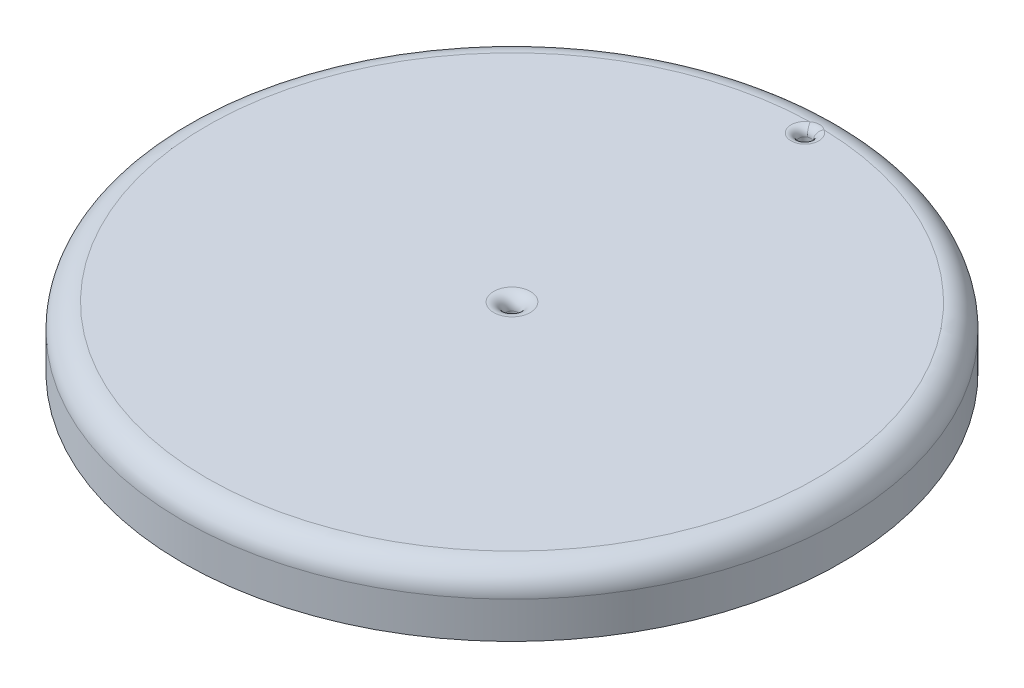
ISO-10303-21;
HEADER;
FILE_DESCRIPTION(('STEP AP214'),'2;1');
FILE_NAME('part.step','',(''),(''),'','','');
FILE_SCHEMA(('AUTOMOTIVE_DESIGN { 1 0 10303 214 1 1 1 1 }'));
ENDSEC;
DATA;
#1=APPLICATION_CONTEXT('core data for automotive mechanical design processes');
#2=APPLICATION_PROTOCOL_DEFINITION('international standard','automotive_design',2000,#1);
#3=PRODUCT_CONTEXT('',#1,'mechanical');
#4=PRODUCT('Part','Part','',(#3));
#5=PRODUCT_RELATED_PRODUCT_CATEGORY('part','',(#4));
#6=PRODUCT_DEFINITION_FORMATION('','',#4);
#7=PRODUCT_DEFINITION_CONTEXT('part definition',#1,'design');
#8=PRODUCT_DEFINITION('design','',#6,#7);
#9=PRODUCT_DEFINITION_SHAPE('','',#8);
#10=(LENGTH_UNIT() NAMED_UNIT(*) SI_UNIT(.MILLI.,.METRE.));
#11=(NAMED_UNIT(*) PLANE_ANGLE_UNIT() SI_UNIT($,.RADIAN.));
#12=(NAMED_UNIT(*) SI_UNIT($,.STERADIAN.) SOLID_ANGLE_UNIT());
#13=UNCERTAINTY_MEASURE_WITH_UNIT(LENGTH_MEASURE(1.E-05),#10,'distance_accuracy_value','');
#14=(GEOMETRIC_REPRESENTATION_CONTEXT(3) GLOBAL_UNCERTAINTY_ASSIGNED_CONTEXT((#13)) GLOBAL_UNIT_ASSIGNED_CONTEXT((#10,
#11,#12)) REPRESENTATION_CONTEXT('',''));
#15=CARTESIAN_POINT('',(0.,0.,0.));
#16=DIRECTION('',(0.,0.,1.));
#17=DIRECTION('',(1.,0.,0.));
#18=AXIS2_PLACEMENT_3D('',#15,#16,#17);
#19=CARTESIAN_POINT('',(0.,15.875,0.));
#20=DIRECTION('',(0.,1.,0.));
#21=DIRECTION('',(0.,0.,1.));
#22=AXIS2_PLACEMENT_3D('',#19,#20,#21);
#23=PLANE('',#22);
#24=CARTESIAN_POINT('',(0.,15.875,0.));
#25=DIRECTION('',(0.,1.,0.));
#26=DIRECTION('',(0.,0.,1.));
#27=AXIS2_PLACEMENT_3D('',#24,#25,#26);
#28=CIRCLE('',#27,4.7625);
#29=CARTESIAN_POINT('',(0.,15.875,4.7625));
#30=VERTEX_POINT('',#29);
#31=EDGE_CURVE('E79',#30,#30,#28,.F.);
#32=ORIENTED_EDGE('',*,*,#31,.T.);
#33=EDGE_LOOP('',(#32));
#34=FACE_BOUND('',#33,.T.);
#35=CARTESIAN_POINT('',(0.,15.875,0.));
#36=DIRECTION('',(0.,1.,0.));
#37=DIRECTION('',(0.,0.,1.));
#38=AXIS2_PLACEMENT_3D('',#35,#36,#37);
#39=CIRCLE('',#38,79.375);
#40=CARTESIAN_POINT('',(-1.77358459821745,15.875,-79.3551827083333));
#41=VERTEX_POINT('',#40);
#42=CARTESIAN_POINT('',(1.77358459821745,15.875,-79.3551827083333));
#43=VERTEX_POINT('',#42);
#44=EDGE_CURVE('E127',#41,#43,#39,.T.);
#45=ORIENTED_EDGE('',*,*,#44,.T.);
#46=CARTESIAN_POINT('',(0.,15.875,-76.2));
#47=DIRECTION('',(0.,1.,0.));
#48=DIRECTION('',(0.,0.,1.));
#49=AXIS2_PLACEMENT_3D('',#46,#47,#48);
#50=CIRCLE('',#49,3.6195);
#51=EDGE_CURVE('E49',#43,#41,#50,.F.);
#52=ORIENTED_EDGE('',*,*,#51,.T.);
#53=EDGE_LOOP('',(#45,#52));
#54=FACE_BOUND('',#53,.T.);
#55=ADVANCED_FACE('F36',(#34,#54),#23,.T.);
#56=CARTESIAN_POINT('',(0.,0.,0.));
#57=DIRECTION('',(0.,1.,0.));
#58=DIRECTION('',(0.,0.,1.));
#59=AXIS2_PLACEMENT_3D('',#56,#57,#58);
#60=PLANE('',#59);
#61=CARTESIAN_POINT('',(0.,0.,0.));
#62=DIRECTION('',(0.,1.,0.));
#63=DIRECTION('',(0.,0.,1.));
#64=AXIS2_PLACEMENT_3D('',#61,#62,#63);
#65=CIRCLE('',#64,1.5875);
#66=CARTESIAN_POINT('',(0.,0.,1.5875));
#67=VERTEX_POINT('',#66);
#68=EDGE_CURVE('E117',#67,#67,#65,.T.);
#69=ORIENTED_EDGE('',*,*,#68,.T.);
#70=EDGE_LOOP('',(#69));
#71=FACE_BOUND('',#70,.T.);
#72=CARTESIAN_POINT('',(0.,0.,0.));
#73=DIRECTION('',(0.,1.,0.));
#74=DIRECTION('',(0.,0.,1.));
#75=AXIS2_PLACEMENT_3D('',#72,#73,#74);
#76=CIRCLE('',#75,85.725);
#77=CARTESIAN_POINT('',(0.,0.,85.725));
#78=VERTEX_POINT('',#77);
#79=EDGE_CURVE('E122',#78,#78,#76,.T.);
#80=ORIENTED_EDGE('',*,*,#79,.F.);
#81=EDGE_LOOP('',(#80));
#82=FACE_BOUND('',#81,.T.);
#83=CARTESIAN_POINT('',(0.,0.,-76.2));
#84=DIRECTION('',(0.,1.,0.));
#85=DIRECTION('',(0.,0.,1.));
#86=AXIS2_PLACEMENT_3D('',#83,#84,#85);
#87=CIRCLE('',#86,1.5875);
#88=CARTESIAN_POINT('',(0.,0.,-74.6125));
#89=VERTEX_POINT('',#88);
#90=EDGE_CURVE('E115',#89,#89,#87,.T.);
#91=ORIENTED_EDGE('',*,*,#90,.T.);
#92=EDGE_LOOP('',(#91));
#93=FACE_BOUND('',#92,.T.);
#94=ADVANCED_FACE('F147',(#71,#82,#93),#60,.F.);
#95=CARTESIAN_POINT('',(0.,15.875,0.));
#96=DIRECTION('',(0.,-1.,0.));
#97=DIRECTION('',(0.,0.,-1.));
#98=AXIS2_PLACEMENT_3D('',#95,#96,#97);
#99=CYLINDRICAL_SURFACE('',#98,85.725);
#100=CARTESIAN_POINT('',(0.,9.525,0.));
#101=DIRECTION('',(0.,1.,0.));
#102=DIRECTION('',(0.,0.,1.));
#103=AXIS2_PLACEMENT_3D('',#100,#101,#102);
#104=CIRCLE('',#103,85.725);
#105=CARTESIAN_POINT('',(0.,9.525,85.725));
#106=VERTEX_POINT('',#105);
#107=EDGE_CURVE('E129',#106,#106,#104,.F.);
#108=ORIENTED_EDGE('',*,*,#107,.T.);
#109=EDGE_LOOP('',(#108));
#110=FACE_BOUND('',#109,.T.);
#111=ORIENTED_EDGE('',*,*,#79,.T.);
#112=EDGE_LOOP('',(#111));
#113=FACE_BOUND('',#112,.T.);
#114=ADVANCED_FACE('F109',(#110,#113),#99,.T.);
#115=CARTESIAN_POINT('',(0.,15.875,0.));
#116=DIRECTION('',(0.,-1.,0.));
#117=DIRECTION('',(0.,0.,-1.));
#118=AXIS2_PLACEMENT_3D('',#115,#116,#117);
#119=CYLINDRICAL_SURFACE('',#118,1.5875);
#120=CARTESIAN_POINT('',(0.,12.7,0.));
#121=DIRECTION('',(0.,1.,0.));
#122=DIRECTION('',(0.,0.,1.));
#123=AXIS2_PLACEMENT_3D('',#120,#121,#122);
#124=CIRCLE('',#123,1.5875);
#125=CARTESIAN_POINT('',(0.,12.7,1.5875));
#126=VERTEX_POINT('',#125);
#127=EDGE_CURVE('E132',#126,#126,#124,.T.);
#128=ORIENTED_EDGE('',*,*,#127,.T.);
#129=EDGE_LOOP('',(#128));
#130=FACE_BOUND('',#129,.T.);
#131=ORIENTED_EDGE('',*,*,#68,.F.);
#132=EDGE_LOOP('',(#131));
#133=FACE_BOUND('',#132,.T.);
#134=ADVANCED_FACE('F142',(#130,#133),#119,.F.);
#135=CARTESIAN_POINT('',(0.,15.875,-76.2));
#136=DIRECTION('',(0.,-1.,0.));
#137=DIRECTION('',(0.,0.,-1.));
#138=AXIS2_PLACEMENT_3D('',#135,#136,#137);
#139=CYLINDRICAL_SURFACE('',#138,1.5875);
#140=CARTESIAN_POINT('',(0.,13.843,-76.2));
#141=DIRECTION('',(0.,1.,0.));
#142=DIRECTION('',(0.,0.,1.));
#143=AXIS2_PLACEMENT_3D('',#140,#141,#142);
#144=CIRCLE('',#143,1.5875);
#145=CARTESIAN_POINT('',(-0.777887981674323,13.843,-77.5838520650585));
#146=VERTEX_POINT('',#145);
#147=CARTESIAN_POINT('',(0.777887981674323,13.843,-77.5838520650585));
#148=VERTEX_POINT('',#147);
#149=EDGE_CURVE('E77',#146,#148,#144,.T.);
#150=ORIENTED_EDGE('',*,*,#149,.T.);
#151=CARTESIAN_POINT('',(2.63476197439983,15.8003909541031,-78.360166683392));
#152=CARTESIAN_POINT('',(1.29553027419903,15.6046192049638,-77.1386593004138));
#153=CARTESIAN_POINT('',(1.16017491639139,13.7922658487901,-77.2835822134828));
#154=CARTESIAN_POINT('',(2.57294908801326,15.8152666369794,-78.4585026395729));
#155=CARTESIAN_POINT('',(1.25561948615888,15.6322657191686,-77.1888661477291));
#156=CARTESIAN_POINT('',(1.13249688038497,13.8023813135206,-77.3132212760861));
#157=CARTESIAN_POINT('',(2.50832767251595,15.8273547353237,-78.553426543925));
#158=CARTESIAN_POINT('',(1.21430838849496,15.6583466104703,-77.2355977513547));
#159=CARTESIAN_POINT('',(1.10363331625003,13.8106012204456,-77.3418428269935));
#160=CARTESIAN_POINT('',(2.37392623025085,15.8468919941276,-78.7357579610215));
#161=CARTESIAN_POINT('',(1.1296876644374,15.7079386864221,-77.3225792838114));
#162=CARTESIAN_POINT('',(1.0437372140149,13.823886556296,-77.3968373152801));
#163=CARTESIAN_POINT('',(2.30414921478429,15.8543438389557,-78.823169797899));
#164=CARTESIAN_POINT('',(1.08633357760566,15.731447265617,-77.3628095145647));
#165=CARTESIAN_POINT('',(1.01270594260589,13.8289538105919,-77.4232115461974));
#166=CARTESIAN_POINT('',(2.08797842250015,15.8711430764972,-79.0728964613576));
#167=CARTESIAN_POINT('',(0.954443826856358,15.7988444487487,-77.4741569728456));
#168=CARTESIAN_POINT('',(0.916754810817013,13.8403772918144,-77.4985817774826));
#169=CARTESIAN_POINT('',(1.93446767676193,15.874991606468,-79.2231430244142));
#170=CARTESIAN_POINT('',(0.864910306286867,15.839058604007,-77.5349037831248));
#171=CARTESIAN_POINT('',(0.848853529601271,13.8429942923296,-77.5439581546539));
#172=CARTESIAN_POINT('',(1.59737548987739,15.8750091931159,-79.4998007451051));
#173=CARTESIAN_POINT('',(0.680776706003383,15.9151082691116,-77.6384751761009));
#174=CARTESIAN_POINT('',(0.700162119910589,13.843006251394,-77.6275463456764));
#175=CARTESIAN_POINT('',(1.41232254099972,15.870411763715,-79.6225778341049));
#176=CARTESIAN_POINT('',(0.58694637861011,15.9498324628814,-77.6783200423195));
#177=CARTESIAN_POINT('',(0.618760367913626,13.8398799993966,-77.6646638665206));
#178=CARTESIAN_POINT('',(1.02991920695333,15.8595849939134,-79.8212372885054));
#179=CARTESIAN_POINT('',(0.408131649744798,16.0082118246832,-77.7377187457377));
#180=CARTESIAN_POINT('',(0.450866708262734,13.8325177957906,-77.7247378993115));
#181=CARTESIAN_POINT('',(0.832564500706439,15.8533550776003,-79.8971030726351));
#182=CARTESIAN_POINT('',(0.323813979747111,16.0315118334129,-77.7567594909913));
#183=CARTESIAN_POINT('',(0.364373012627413,13.8282814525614,-77.7476894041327));
#184=CARTESIAN_POINT('',(0.431488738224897,15.8442989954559,-79.9997887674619));
#185=CARTESIAN_POINT('',(0.162220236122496,16.0638111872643,-77.7815404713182));
#186=CARTESIAN_POINT('',(0.188758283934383,13.8221233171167,-77.7787575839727));
#187=CARTESIAN_POINT('',(0.227768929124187,15.8414721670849,-80.0266182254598));
#188=CARTESIAN_POINT('',(0.0856994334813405,16.0725404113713,-77.78705194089));
#189=CARTESIAN_POINT('',(0.0996377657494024,13.8202010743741,-77.7868771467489));
#190=CARTESIAN_POINT('',(-0.179926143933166,15.8410812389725,-80.0305067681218));
#191=CARTESIAN_POINT('',(-0.0677330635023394,16.0737995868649,-77.7878985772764));
#192=CARTESIAN_POINT('',(-0.0787089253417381,13.8199352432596,-77.7880538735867));
#193=CARTESIAN_POINT('',(-0.383901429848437,15.8435176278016,-80.0075612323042));
#194=CARTESIAN_POINT('',(-0.143910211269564,16.0663160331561,-77.7832249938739));
#195=CARTESIAN_POINT('',(-0.167935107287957,13.8215919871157,-77.7811096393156));
#196=CARTESIAN_POINT('',(-0.793802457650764,15.8522364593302,-79.9106665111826));
#197=CARTESIAN_POINT('',(-0.307524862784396,16.035720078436,-77.7601685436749));
#198=CARTESIAN_POINT('',(-0.347389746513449,13.8275207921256,-77.7517927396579));
#199=CARTESIAN_POINT('',(-0.999493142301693,15.8586654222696,-79.8347599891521));
#200=CARTESIAN_POINT('',(-0.394481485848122,16.0122886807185,-77.7414868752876));
#201=CARTESIAN_POINT('',(-0.437521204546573,13.8318924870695,-77.7288279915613));
#202=CARTESIAN_POINT('',(-1.39783616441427,15.8700525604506,-79.6321430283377));
#203=CARTESIAN_POINT('',(-0.579575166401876,15.9525759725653,-77.6814351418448));
#204=CARTESIAN_POINT('',(-0.612388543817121,13.8396357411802,-77.6675555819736));
#205=CARTESIAN_POINT('',(-1.59049234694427,15.8750111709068,-79.5054476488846));
#206=CARTESIAN_POINT('',(-0.676953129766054,15.9166930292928,-77.6406278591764));
#207=CARTESIAN_POINT('',(-0.697126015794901,13.843007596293,-77.6292524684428));
#208=CARTESIAN_POINT('',(-1.93450101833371,15.874990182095,-79.2231176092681));
#209=CARTESIAN_POINT('',(-0.864920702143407,15.8390495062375,-77.5348962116));
#210=CARTESIAN_POINT('',(-0.848868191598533,13.8429933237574,-77.5439504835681));
#211=CARTESIAN_POINT('',(-2.0880299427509,15.8711415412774,-79.0728466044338));
#212=CARTESIAN_POINT('',(-0.954472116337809,15.7988308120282,-77.4741373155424));
#213=CARTESIAN_POINT('',(-0.916777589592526,13.8403762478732,-77.498566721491));
#214=CARTESIAN_POINT('',(-2.30420464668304,15.8543382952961,-78.8231009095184));
#215=CARTESIAN_POINT('',(-1.08636872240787,15.7314289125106,-77.3627777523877));
#216=CARTESIAN_POINT('',(-1.01273059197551,13.8289500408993,-77.4231907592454));
#217=CARTESIAN_POINT('',(-2.37396843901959,15.8468866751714,-78.7357025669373));
#218=CARTESIAN_POINT('',(-1.12971452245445,15.7079237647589,-77.3225531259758));
#219=CARTESIAN_POINT('',(-1.04375600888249,13.8238829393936,-77.3968206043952));
#220=CARTESIAN_POINT('',(-2.50834716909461,15.8273510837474,-78.5533982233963));
#221=CARTESIAN_POINT('',(-1.21432050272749,15.6583387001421,-77.2355838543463));
#222=CARTESIAN_POINT('',(-1.10364202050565,13.8105987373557,-77.34183428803));
#223=CARTESIAN_POINT('',(-2.57295894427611,15.8152642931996,-78.4584876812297));
#224=CARTESIAN_POINT('',(-1.25562507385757,15.6322613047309,-77.1888586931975));
#225=CARTESIAN_POINT('',(-1.13250128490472,13.8023797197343,-77.3132167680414));
#226=CARTESIAN_POINT('',(-2.63476197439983,15.8003909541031,-78.360166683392));
#227=CARTESIAN_POINT('',(-1.29553027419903,15.6046192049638,-77.1386593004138));
#228=CARTESIAN_POINT('',(-1.16017491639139,13.7922658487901,-77.2835822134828));
#229=(BOUNDED_SURFACE() B_SPLINE_SURFACE(3,2,((#151,#152,#153),(#154,#155,#156),(#157,#158,
#159),(#160,#161,#162),(#163,#164,#165),(#166,#167,#168),(#169,#170,#171),(#172,#173,#174),
(#175,#176,#177),(#178,#179,#180),(#181,#182,#183),(#184,#185,#186),(#187,#188,#189),(#190,#191,
#192),(#193,#194,#195),(#196,#197,#198),(#199,#200,#201),(#202,#203,#204),(#205,#206,#207),
(#208,#209,#210),(#211,#212,#213),(#214,#215,#216),(#217,#218,#219),(#220,#221,#222),(#223,#224,
#225),(#226,#227,#228)),.UNSPECIFIED.,.F.,.F.,.F.) B_SPLINE_SURFACE_WITH_KNOTS((4,2,2,2,2,2,2,2,
2,2,2,2,4),(3,3),(0.,0.278848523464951,0.557535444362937,1.11367568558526,1.72279490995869,
2.33212931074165,2.94134506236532,3.55061736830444,4.18368960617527,4.81657427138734,
5.37280499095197,5.6514424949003,5.93024974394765),(0.,1.),
.UNSPECIFIED.) GEOMETRIC_REPRESENTATION_ITEM() RATIONAL_B_SPLINE_SURFACE(((1.,0.744318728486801,
1.),(1.,0.741621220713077,1.),(1.,0.738734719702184,1.),(1.,0.732715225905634,1.),(1.,
0.72958237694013,1.),(1.,0.720020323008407,1.),(1.,0.713414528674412,1.),(1.,0.700198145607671,
1.),(1.,0.693647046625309,1.),(1.,0.682501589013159,1.),(1.,0.677907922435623,1.),(1.,
0.671584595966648,1.),(1.,0.669854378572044,1.),(1.,0.669606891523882,1.),(1.,0.671089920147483,
1.),(1.,0.677085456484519,1.),(1.,0.681714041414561,1.),(1.,0.693135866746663,1.),(1.,
0.699928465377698,1.),(1.,0.713415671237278,1.),(1.,0.720022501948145,1.),(1.,0.729584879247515,
1.),(1.,0.73271712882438,1.),(1.,0.738735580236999,1.),(1.,0.741621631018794,1.),(1.,
0.744318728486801,1.))) REPRESENTATION_ITEM('') SURFACE());
#230=CARTESIAN_POINT('',(1.16017491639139,13.7922658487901,-77.2835822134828));
#231=CARTESIAN_POINT('',(1.13249688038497,13.8023813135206,-77.3132212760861));
#232=CARTESIAN_POINT('',(1.10363331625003,13.8106012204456,-77.3418428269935));
#233=CARTESIAN_POINT('',(1.0437372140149,13.823886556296,-77.3968373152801));
#234=CARTESIAN_POINT('',(1.01270594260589,13.8289538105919,-77.4232115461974));
#235=CARTESIAN_POINT('',(0.916754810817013,13.8403772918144,-77.4985817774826));
#236=CARTESIAN_POINT('',(0.848853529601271,13.8429942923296,-77.5439581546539));
#237=CARTESIAN_POINT('',(0.700162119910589,13.843006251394,-77.6275463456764));
#238=CARTESIAN_POINT('',(0.618760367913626,13.8398799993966,-77.6646638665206));
#239=CARTESIAN_POINT('',(0.450866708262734,13.8325177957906,-77.7247378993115));
#240=CARTESIAN_POINT('',(0.364373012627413,13.8282814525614,-77.7476894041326));
#241=CARTESIAN_POINT('',(0.188758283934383,13.8221233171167,-77.7787575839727));
#242=CARTESIAN_POINT('',(0.0996377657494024,13.8202010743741,-77.7868771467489));
#243=CARTESIAN_POINT('',(-0.0787089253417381,13.8199352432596,-77.7880538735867));
#244=CARTESIAN_POINT('',(-0.167935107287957,13.8215919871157,-77.7811096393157));
#245=CARTESIAN_POINT('',(-0.347389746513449,13.8275207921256,-77.7517927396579));
#246=CARTESIAN_POINT('',(-0.437521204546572,13.8318924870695,-77.7288279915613));
#247=CARTESIAN_POINT('',(-0.612388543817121,13.8396357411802,-77.6675555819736));
#248=CARTESIAN_POINT('',(-0.697126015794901,13.843007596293,-77.6292524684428));
#249=CARTESIAN_POINT('',(-0.848868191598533,13.8429933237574,-77.5439504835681));
#250=CARTESIAN_POINT('',(-0.916777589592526,13.8403762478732,-77.498566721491));
#251=CARTESIAN_POINT('',(-1.01273059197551,13.8289500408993,-77.4231907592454));
#252=CARTESIAN_POINT('',(-1.04375600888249,13.8238829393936,-77.3968206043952));
#253=CARTESIAN_POINT('',(-1.10364202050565,13.8105987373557,-77.34183428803));
#254=CARTESIAN_POINT('',(-1.13250128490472,13.8023797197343,-77.3132167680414));
#255=CARTESIAN_POINT('',(-1.16017491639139,13.7922658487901,-77.2835822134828));
#256=B_SPLINE_CURVE_WITH_KNOTS('',3,(#230,#231,#232,#233,#234,#235,#236,#237,#238,#239,#240,
#241,#242,#243,#244,#245,#246,#247,#248,#249,#250,#251,#252,#253,#254,#255),.UNSPECIFIED.,.F.,
.F.,(4,2,2,2,2,2,2,2,2,2,2,2,4),(0.,0.278848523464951,0.557535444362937,1.11367568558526,
1.72279490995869,2.33212931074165,2.94134506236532,3.55061736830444,4.18368960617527,
4.81657427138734,5.37280499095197,5.6514424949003,5.93024974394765),.UNSPECIFIED.);
#257=EDGE_CURVE('E74',#148,#146,#256,.T.);
#258=ORIENTED_EDGE('',*,*,#257,.T.);
#259=EDGE_LOOP('',(#150,#258));
#260=FACE_BOUND('',#259,.T.);
#261=ORIENTED_EDGE('',*,*,#90,.F.);
#262=EDGE_LOOP('',(#261));
#263=FACE_BOUND('',#262,.T.);
#264=ADVANCED_FACE('F81',(#260,#263),#139,.F.);
#265=CARTESIAN_POINT('',(0.,9.525,0.));
#266=DIRECTION('',(0.,1.,0.));
#267=DIRECTION('',(0.,0.,1.));
#268=AXIS2_PLACEMENT_3D('',#265,#266,#267);
#269=TOROIDAL_SURFACE('',#268,79.375,6.35);
#270=ORIENTED_EDGE('',*,*,#107,.F.);
#271=EDGE_LOOP('',(#270));
#272=FACE_BOUND('',#271,.T.);
#273=ORIENTED_EDGE('',*,*,#44,.F.);
#274=CARTESIAN_POINT('',(-2.63476197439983,15.8003909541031,-78.360166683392));
#275=CARTESIAN_POINT('',(-2.57295894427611,15.8152642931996,-78.4584876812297));
#276=CARTESIAN_POINT('',(-2.50834716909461,15.8273510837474,-78.5533982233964));
#277=CARTESIAN_POINT('',(-2.37396843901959,15.8468866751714,-78.7357025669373));
#278=CARTESIAN_POINT('',(-2.30420464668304,15.8543382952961,-78.8231009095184));
#279=CARTESIAN_POINT('',(-2.0880299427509,15.8711415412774,-79.0728466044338));
#280=CARTESIAN_POINT('',(-1.93450101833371,15.874990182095,-79.223117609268));
#281=CARTESIAN_POINT('',(-1.59049234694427,15.8750111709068,-79.5054476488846));
#282=CARTESIAN_POINT('',(-1.39783616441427,15.8700525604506,-79.6321430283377));
#283=CARTESIAN_POINT('',(-0.999493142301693,15.8586654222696,-79.8347599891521));
#284=CARTESIAN_POINT('',(-0.793802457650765,15.8522364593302,-79.9106665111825));
#285=CARTESIAN_POINT('',(-0.383901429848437,15.8435176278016,-80.0075612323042));
#286=CARTESIAN_POINT('',(-0.179926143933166,15.8410812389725,-80.0305067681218));
#287=CARTESIAN_POINT('',(0.227768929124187,15.8414721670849,-80.0266182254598));
#288=CARTESIAN_POINT('',(0.431488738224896,15.8442989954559,-79.9997887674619));
#289=CARTESIAN_POINT('',(0.832564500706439,15.8533550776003,-79.8971030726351));
#290=CARTESIAN_POINT('',(1.02991920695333,15.8595849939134,-79.8212372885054));
#291=CARTESIAN_POINT('',(1.41232254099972,15.870411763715,-79.6225778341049));
#292=CARTESIAN_POINT('',(1.59737548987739,15.8750091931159,-79.4998007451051));
#293=CARTESIAN_POINT('',(1.93446767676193,15.874991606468,-79.2231430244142));
#294=CARTESIAN_POINT('',(2.08797842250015,15.8711430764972,-79.0728964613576));
#295=CARTESIAN_POINT('',(2.30414921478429,15.8543438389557,-78.8231697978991));
#296=CARTESIAN_POINT('',(2.37392623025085,15.8468919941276,-78.7357579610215));
#297=CARTESIAN_POINT('',(2.50832767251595,15.8273547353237,-78.553426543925));
#298=CARTESIAN_POINT('',(2.57294908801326,15.8152666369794,-78.4585026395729));
#299=CARTESIAN_POINT('',(2.63476197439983,15.8003909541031,-78.360166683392));
#300=B_SPLINE_CURVE_WITH_KNOTS('',3,(#274,#275,#276,#277,#278,#279,#280,#281,#282,#283,#284,
#285,#286,#287,#288,#289,#290,#291,#292,#293,#294,#295,#296,#297,#298,#299),.UNSPECIFIED.,.F.,
.F.,(4,2,2,2,2,2,2,2,2,2,2,2,4),(0.,0.278807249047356,0.557444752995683,1.11367547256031,
1.74656013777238,2.37963237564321,2.98890468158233,3.598120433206,4.20745483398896,
4.81657405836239,5.37271429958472,5.6514012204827,5.93024974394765),.UNSPECIFIED.);
#301=EDGE_CURVE('E11',#41,#43,#300,.T.);
#302=ORIENTED_EDGE('',*,*,#301,.T.);
#303=EDGE_LOOP('',(#273,#302));
#304=FACE_BOUND('',#303,.T.);
#305=ADVANCED_FACE('F104',(#272,#304),#269,.T.);
#306=CARTESIAN_POINT('',(0.,12.7,0.));
#307=DIRECTION('',(0.,1.,0.));
#308=DIRECTION('',(0.,0.,1.));
#309=AXIS2_PLACEMENT_3D('',#306,#307,#308);
#310=TOROIDAL_SURFACE('',#309,4.7625,3.175);
#311=ORIENTED_EDGE('',*,*,#31,.F.);
#312=EDGE_LOOP('',(#311));
#313=FACE_BOUND('',#312,.T.);
#314=ORIENTED_EDGE('',*,*,#127,.F.);
#315=EDGE_LOOP('',(#314));
#316=FACE_BOUND('',#315,.T.);
#317=ADVANCED_FACE('F97',(#313,#316),#310,.T.);
#318=CARTESIAN_POINT('',(0.,13.843,-76.2));
#319=DIRECTION('',(0.,1.,0.));
#320=DIRECTION('',(0.,0.,1.));
#321=AXIS2_PLACEMENT_3D('',#318,#319,#320);
#322=TOROIDAL_SURFACE('',#321,3.6195,2.032);
#323=CARTESIAN_POINT('',(-1.77358459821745,13.843,-79.3551827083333));
#324=DIRECTION('',(0.871717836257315,0.,-0.490008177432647));
#325=DIRECTION('',(-0.490008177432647,0.,-0.871717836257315));
#326=AXIS2_PLACEMENT_3D('',#323,#324,#325);
#327=CIRCLE('',#326,2.032);
#328=EDGE_CURVE('E70',#41,#146,#327,.T.);
#329=ORIENTED_EDGE('',*,*,#328,.F.);
#330=ORIENTED_EDGE('',*,*,#51,.F.);
#331=CARTESIAN_POINT('',(1.77358459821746,13.843,-79.3551827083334));
#332=DIRECTION('',(-0.871717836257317,0.,-0.490008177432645));
#333=DIRECTION('',(-0.490008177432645,0.,0.871717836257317));
#334=AXIS2_PLACEMENT_3D('',#331,#332,#333);
#335=CIRCLE('',#334,2.032);
#336=EDGE_CURVE('E63',#148,#43,#335,.T.);
#337=ORIENTED_EDGE('',*,*,#336,.F.);
#338=ORIENTED_EDGE('',*,*,#149,.F.);
#339=EDGE_LOOP('',(#329,#330,#337,#338));
#340=FACE_BOUND('',#339,.T.);
#341=ADVANCED_FACE('F38',(#340),#322,.T.);
#342=ORIENTED_EDGE('',*,*,#336,.T.);
#343=ORIENTED_EDGE('',*,*,#301,.F.);
#344=ORIENTED_EDGE('',*,*,#328,.T.);
#345=ORIENTED_EDGE('',*,*,#257,.F.);
#346=EDGE_LOOP('',(#342,#343,#344,#345));
#347=FACE_BOUND('',#346,.T.);
#348=ADVANCED_FACE('F72',(#347),#229,.T.);
#349=CLOSED_SHELL('',(#55,#94,#114,#134,#264,#305,#317,#341,#348));
#350=MANIFOLD_SOLID_BREP('B2',#349);
#351=ADVANCED_BREP_SHAPE_REPRESENTATION('',(#18,#350),#14);
#352=SHAPE_DEFINITION_REPRESENTATION(#9,#351);
ENDSEC;
END-ISO-10303-21;
